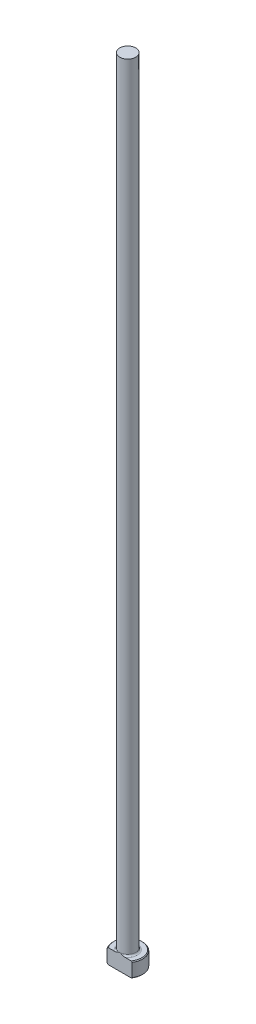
ISO-10303-21;
HEADER;
FILE_DESCRIPTION(('STEP AP214'),'2;1');
FILE_NAME('part.step','',(''),(''),'','','');
FILE_SCHEMA(('AUTOMOTIVE_DESIGN { 1 0 10303 214 1 1 1 1 }'));
ENDSEC;
DATA;
#1=APPLICATION_CONTEXT('core data for automotive mechanical design processes');
#2=APPLICATION_PROTOCOL_DEFINITION('international standard','automotive_design',2000,#1);
#3=PRODUCT_CONTEXT('',#1,'mechanical');
#4=PRODUCT('Part','Part','',(#3));
#5=PRODUCT_RELATED_PRODUCT_CATEGORY('part','',(#4));
#6=PRODUCT_DEFINITION_FORMATION('','',#4);
#7=PRODUCT_DEFINITION_CONTEXT('part definition',#1,'design');
#8=PRODUCT_DEFINITION('design','',#6,#7);
#9=PRODUCT_DEFINITION_SHAPE('','',#8);
#10=(LENGTH_UNIT() NAMED_UNIT(*) SI_UNIT(.MILLI.,.METRE.));
#11=(NAMED_UNIT(*) PLANE_ANGLE_UNIT() SI_UNIT($,.RADIAN.));
#12=(NAMED_UNIT(*) SI_UNIT($,.STERADIAN.) SOLID_ANGLE_UNIT());
#13=UNCERTAINTY_MEASURE_WITH_UNIT(LENGTH_MEASURE(1.E-05),#10,'distance_accuracy_value','');
#14=(GEOMETRIC_REPRESENTATION_CONTEXT(3) GLOBAL_UNCERTAINTY_ASSIGNED_CONTEXT((#13)) GLOBAL_UNIT_ASSIGNED_CONTEXT((#10,
#11,#12)) REPRESENTATION_CONTEXT('',''));
#15=CARTESIAN_POINT('',(0.,0.,0.));
#16=DIRECTION('',(0.,0.,1.));
#17=DIRECTION('',(1.,0.,0.));
#18=AXIS2_PLACEMENT_3D('',#15,#16,#17);
#19=CARTESIAN_POINT('',(0.,0.,0.));
#20=DIRECTION('',(0.,-1.,0.));
#21=DIRECTION('',(0.,0.,-1.));
#22=AXIS2_PLACEMENT_3D('',#19,#20,#21);
#23=PLANE('',#22);
#24=CARTESIAN_POINT('',(0.,0.,0.));
#25=DIRECTION('',(0.,-1.,0.));
#26=DIRECTION('',(0.,0.,-1.));
#27=AXIS2_PLACEMENT_3D('',#24,#25,#26);
#28=CIRCLE('',#27,4.5085);
#29=CARTESIAN_POINT('',(-3.69775913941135,0.,2.57936999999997));
#30=VERTEX_POINT('',#29);
#31=CARTESIAN_POINT('',(3.69775913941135,0.,2.57936999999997));
#32=VERTEX_POINT('',#31);
#33=EDGE_CURVE('E98',#30,#32,#28,.T.);
#34=ORIENTED_EDGE('',*,*,#33,.T.);
#35=DIRECTION('',(-1.,0.,0.));
#36=VECTOR('',#35,1.);
#37=CARTESIAN_POINT('',(-4.0035305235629,0.,2.57936999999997));
#38=LINE('',#37,#36);
#39=EDGE_CURVE('E83',#32,#30,#38,.T.);
#40=ORIENTED_EDGE('',*,*,#39,.T.);
#41=EDGE_LOOP('',(#34,#40));
#42=FACE_BOUND('',#41,.T.);
#43=ADVANCED_FACE('F32',(#42),#23,.T.);
#44=CARTESIAN_POINT('',(0.,259.958771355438,0.));
#45=DIRECTION('',(0.,1.,0.));
#46=DIRECTION('',(0.,0.,1.));
#47=AXIS2_PLACEMENT_3D('',#44,#45,#46);
#48=CYLINDRICAL_SURFACE('',#47,4.76249999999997);
#49=CARTESIAN_POINT('',(0.,4.49580000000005,0.));
#50=DIRECTION('',(0.,1.,0.));
#51=DIRECTION('',(0.,0.,1.));
#52=AXIS2_PLACEMENT_3D('',#49,#50,#51);
#53=CIRCLE('',#52,4.76249999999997);
#54=CARTESIAN_POINT('',(-4.0035305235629,4.49580000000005,2.57936999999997));
#55=VERTEX_POINT('',#54);
#56=CARTESIAN_POINT('',(4.0035305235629,4.49580000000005,2.57936999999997));
#57=VERTEX_POINT('',#56);
#58=EDGE_CURVE('E104',#55,#57,#53,.F.);
#59=ORIENTED_EDGE('',*,*,#58,.T.);
#60=DIRECTION('',(0.,-1.,0.));
#61=VECTOR('',#60,1.);
#62=CARTESIAN_POINT('',(4.0035305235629,254.,2.57936999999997));
#63=LINE('',#62,#61);
#64=CARTESIAN_POINT('',(4.0035305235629,0.254000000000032,2.57936999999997));
#65=VERTEX_POINT('',#64);
#66=EDGE_CURVE('E183',#57,#65,#63,.T.);
#67=ORIENTED_EDGE('',*,*,#66,.T.);
#68=CARTESIAN_POINT('',(0.,0.254000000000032,0.));
#69=DIRECTION('',(0.,-1.,0.));
#70=DIRECTION('',(0.,0.,-1.));
#71=AXIS2_PLACEMENT_3D('',#68,#69,#70);
#72=CIRCLE('',#71,4.76249999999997);
#73=CARTESIAN_POINT('',(-4.0035305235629,0.254000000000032,2.57936999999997));
#74=VERTEX_POINT('',#73);
#75=EDGE_CURVE('E100',#65,#74,#72,.F.);
#76=ORIENTED_EDGE('',*,*,#75,.T.);
#77=DIRECTION('',(0.,-1.,0.));
#78=VECTOR('',#77,1.);
#79=CARTESIAN_POINT('',(-4.0035305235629,254.,2.57936999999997));
#80=LINE('',#79,#78);
#81=EDGE_CURVE('E93',#55,#74,#80,.T.);
#82=ORIENTED_EDGE('',*,*,#81,.F.);
#83=EDGE_LOOP('',(#59,#67,#76,#82));
#84=FACE_BOUND('',#83,.T.);
#85=ADVANCED_FACE('F158',(#84),#48,.T.);
#86=CARTESIAN_POINT('',(-4.76249999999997,4.7498,0.));
#87=DIRECTION('',(0.,1.,0.));
#88=DIRECTION('',(0.,0.,1.));
#89=AXIS2_PLACEMENT_3D('',#86,#87,#88);
#90=PLANE('',#89);
#91=CARTESIAN_POINT('',(0.,4.7498,0.));
#92=DIRECTION('',(0.,1.,0.));
#93=DIRECTION('',(0.,0.,1.));
#94=AXIS2_PLACEMENT_3D('',#91,#92,#93);
#95=CIRCLE('',#94,4.50850000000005);
#96=CARTESIAN_POINT('',(3.69775913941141,4.7498,2.57936999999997));
#97=VERTEX_POINT('',#96);
#98=CARTESIAN_POINT('',(-3.69775913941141,4.7498,2.57936999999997));
#99=VERTEX_POINT('',#98);
#100=EDGE_CURVE('E178',#97,#99,#95,.T.);
#101=ORIENTED_EDGE('',*,*,#100,.T.);
#102=DIRECTION('',(1.,0.,0.));
#103=VECTOR('',#102,1.);
#104=CARTESIAN_POINT('',(-4.76249999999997,4.7498,2.57936999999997));
#105=LINE('',#104,#103);
#106=CARTESIAN_POINT('',(-1.69667437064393,4.74979999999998,2.57936999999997));
#107=VERTEX_POINT('',#106);
#108=EDGE_CURVE('E57',#99,#107,#105,.T.);
#109=ORIENTED_EDGE('',*,*,#108,.T.);
#110=CARTESIAN_POINT('',(0.,4.7498,0.));
#111=DIRECTION('',(0.,1.,0.));
#112=DIRECTION('',(0.,0.,1.));
#113=AXIS2_PLACEMENT_3D('',#110,#111,#112);
#114=CIRCLE('',#113,3.08736999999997);
#115=CARTESIAN_POINT('',(1.69667437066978,4.74979999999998,2.57936999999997));
#116=VERTEX_POINT('',#115);
#117=EDGE_CURVE('E107',#107,#116,#114,.F.);
#118=ORIENTED_EDGE('',*,*,#117,.T.);
#119=EDGE_CURVE('E136',#116,#97,#105,.T.);
#120=ORIENTED_EDGE('',*,*,#119,.T.);
#121=EDGE_LOOP('',(#101,#109,#118,#120));
#122=FACE_BOUND('',#121,.T.);
#123=ADVANCED_FACE('F147',(#122),#90,.T.);
#124=CARTESIAN_POINT('',(0.,4.74980000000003,0.));
#125=DIRECTION('',(0.,-1.,0.));
#126=DIRECTION('',(0.,0.,-1.));
#127=AXIS2_PLACEMENT_3D('',#124,#125,#126);
#128=CONICAL_SURFACE('',#127,4.50850000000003,0.78539816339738);
#129=ORIENTED_EDGE('',*,*,#58,.F.);
#130=CARTESIAN_POINT('',(-8.81038376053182,0.0781032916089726,2.57936999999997));
#131=CARTESIAN_POINT('',(-8.63817215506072,0.243370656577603,2.57936999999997));
#132=CARTESIAN_POINT('',(-8.46577580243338,0.408446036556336,2.57936999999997));
#133=CARTESIAN_POINT('',(-8.12052663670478,0.738121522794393,2.57936999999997));
#134=CARTESIAN_POINT('',(-7.94767381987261,0.90272162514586,2.57936999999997));
#135=CARTESIAN_POINT('',(-7.60137761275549,1.23139996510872,2.57936999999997));
#136=CARTESIAN_POINT('',(-7.42793406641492,1.39547803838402,2.57936999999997));
#137=CARTESIAN_POINT('',(-7.08039096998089,1.72293720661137,2.57936999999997));
#138=CARTESIAN_POINT('',(-6.90629142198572,1.88631830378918,2.57936999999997));
#139=CARTESIAN_POINT('',(-6.55996911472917,2.20971408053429,2.57936999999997));
#140=CARTESIAN_POINT('',(-6.38775863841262,2.36974190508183,2.57936999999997));
#141=CARTESIAN_POINT('',(-6.04236978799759,2.68874934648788,2.57936999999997));
#142=CARTESIAN_POINT('',(-5.86919141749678,2.8477289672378,2.57936999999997));
#143=CARTESIAN_POINT('',(-5.52163609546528,3.16432986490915,2.57936999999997));
#144=CARTESIAN_POINT('',(-5.34725929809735,3.32195131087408,2.57936999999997));
#145=CARTESIAN_POINT('',(-4.99694410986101,3.63544705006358,2.57936999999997));
#146=CARTESIAN_POINT('',(-4.82100574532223,3.79132137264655,2.57936999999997));
#147=CARTESIAN_POINT('',(-4.49753352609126,4.07410257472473,2.57936999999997));
#148=CARTESIAN_POINT('',(-4.35032232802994,4.20137795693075,2.57936999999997));
#149=CARTESIAN_POINT('',(-4.05409296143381,4.45384309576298,2.57936999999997));
#150=CARTESIAN_POINT('',(-3.90507461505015,4.579032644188,2.57936999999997));
#151=CARTESIAN_POINT('',(-3.60326498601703,4.82780550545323,2.57936999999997));
#152=CARTESIAN_POINT('',(-3.4504511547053,4.95136158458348,2.57936999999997));
#153=CARTESIAN_POINT('',(-3.14173703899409,5.19448315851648,2.57936999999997));
#154=CARTESIAN_POINT('',(-2.98583759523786,5.31404971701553,2.57936999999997));
#155=CARTESIAN_POINT('',(-2.66761175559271,5.54917953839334,2.57936999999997));
#156=CARTESIAN_POINT('',(-2.50522602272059,5.66466361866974,2.57936999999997));
#157=CARTESIAN_POINT('',(-2.25707238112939,5.83137640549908,2.57936999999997));
#158=CARTESIAN_POINT('',(-2.17352383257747,5.88590247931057,2.57936999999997));
#159=CARTESIAN_POINT('',(-2.00468213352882,5.99217332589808,2.57936999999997));
#160=CARTESIAN_POINT('',(-1.9193891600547,6.04391837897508,2.57936999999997));
#161=CARTESIAN_POINT('',(-1.747727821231,6.14335743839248,2.57936999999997));
#162=CARTESIAN_POINT('',(-1.66138240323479,6.19109052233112,2.57936999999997));
#163=CARTESIAN_POINT('',(-1.48644296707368,6.28221543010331,2.57936999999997));
#164=CARTESIAN_POINT('',(-1.39784850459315,6.32560638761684,2.57936999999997));
#165=CARTESIAN_POINT('',(-1.12872329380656,6.44731582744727,2.57936999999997));
#166=CARTESIAN_POINT('',(-0.944205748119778,6.5175637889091,2.57936999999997));
#167=CARTESIAN_POINT('',(-0.668471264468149,6.59500577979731,2.57936999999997));
#168=CARTESIAN_POINT('',(-0.58102669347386,6.61572186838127,2.57936999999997));
#169=CARTESIAN_POINT('',(-0.404544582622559,6.64883575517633,2.57936999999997));
#170=CARTESIAN_POINT('',(-0.315507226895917,6.66123450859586,2.57936999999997));
#171=CARTESIAN_POINT('',(-0.136997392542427,6.67681756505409,2.57936999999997));
#172=CARTESIAN_POINT('',(-0.0475283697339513,6.68004079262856,2.57936999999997));
#173=CARTESIAN_POINT('',(0.131260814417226,6.67713971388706,2.57936999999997));
#174=CARTESIAN_POINT('',(0.220580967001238,6.67101487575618,2.57936999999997));
#175=CARTESIAN_POINT('',(0.39751372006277,6.64994857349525,2.57936999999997));
#176=CARTESIAN_POINT('',(0.485133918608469,6.63506955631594,2.57936999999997));
#177=CARTESIAN_POINT('',(0.658668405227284,6.59750904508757,2.57936999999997));
#178=CARTESIAN_POINT('',(0.744582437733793,6.57482639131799,2.57936999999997));
#179=CARTESIAN_POINT('',(0.914923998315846,6.5226814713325,2.57936999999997));
#180=CARTESIAN_POINT('',(0.999337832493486,6.49317510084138,2.57936999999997));
#181=CARTESIAN_POINT('',(1.16599375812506,6.42867206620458,2.57936999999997));
#182=CARTESIAN_POINT('',(1.24823625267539,6.3936764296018,2.57936999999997));
#183=CARTESIAN_POINT('',(1.48320923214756,6.28604350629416,2.57936999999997));
#184=CARTESIAN_POINT('',(1.63331445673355,6.20769517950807,2.57936999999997));
#185=CARTESIAN_POINT('',(1.92762066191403,6.04050332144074,2.57936999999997));
#186=CARTESIAN_POINT('',(2.07181423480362,5.95164713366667,2.57936999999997));
#187=CARTESIAN_POINT('',(2.3560914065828,5.76650107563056,2.57936999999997));
#188=CARTESIAN_POINT('',(2.4961572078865,5.67018411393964,2.57936999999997));
#189=CARTESIAN_POINT('',(2.77263704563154,5.47262505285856,2.57936999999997));
#190=CARTESIAN_POINT('',(2.90905278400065,5.37138531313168,2.57936999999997));
#191=CARTESIAN_POINT('',(3.18076542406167,5.16408172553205,2.57936999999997));
#192=CARTESIAN_POINT('',(3.31602902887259,5.05797444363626,2.57936999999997));
#193=CARTESIAN_POINT('',(3.58438893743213,4.84303698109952,2.57936999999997));
#194=CARTESIAN_POINT('',(3.71748502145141,4.73420652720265,2.57936999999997));
#195=CARTESIAN_POINT('',(3.9816559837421,4.51474163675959,2.57936999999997));
#196=CARTESIAN_POINT('',(4.1127348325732,4.40411196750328,2.57936999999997));
#197=CARTESIAN_POINT('',(4.37353162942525,4.18125865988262,2.57936999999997));
#198=CARTESIAN_POINT('',(4.5032495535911,4.06903499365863,2.57936999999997));
#199=CARTESIAN_POINT('',(4.81441004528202,3.79717971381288,2.57936999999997));
#200=CARTESIAN_POINT('',(4.99531124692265,3.63692901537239,2.57936999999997));
#201=CARTESIAN_POINT('',(5.35546680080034,3.31458539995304,2.57936999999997));
#202=CARTESIAN_POINT('',(5.53472112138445,3.15249244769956,2.57936999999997));
#203=CARTESIAN_POINT('',(5.89210090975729,2.82676891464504,2.57936999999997));
#204=CARTESIAN_POINT('',(6.07022530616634,2.66313715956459,2.57936999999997));
#205=CARTESIAN_POINT('',(6.42546247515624,2.3347790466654,2.57936999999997));
#206=CARTESIAN_POINT('',(6.60257524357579,2.17005268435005,2.57936999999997));
#207=CARTESIAN_POINT('',(7.12035172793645,1.68613081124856,2.57936999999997));
#208=CARTESIAN_POINT('',(7.45991968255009,1.36576301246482,2.57936999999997));
#209=CARTESIAN_POINT('',(7.96758192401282,0.88377022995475,2.57936999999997));
#210=CARTESIAN_POINT('',(8.13643837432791,0.722945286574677,2.57936999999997));
#211=CARTESIAN_POINT('',(8.47371750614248,0.400843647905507,2.57936999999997));
#212=CARTESIAN_POINT('',(8.64214019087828,0.239566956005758,2.57936999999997));
#213=CARTESIAN_POINT('',(8.81038376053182,0.0781032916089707,2.57936999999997));
#214=B_SPLINE_CURVE_WITH_KNOTS('',3,(#130,#131,#132,#133,#134,#135,#136,#137,#138,#139,#140,
#141,#142,#143,#144,#145,#146,#147,#148,#149,#150,#151,#152,#153,#154,#155,#156,#157,#158,#159,
#160,#161,#162,#163,#164,#165,#166,#167,#168,#169,#170,#171,#172,#173,#174,#175,#176,#177,#178,
#179,#180,#181,#182,#183,#184,#185,#186,#187,#188,#189,#190,#191,#192,#193,#194,#195,#196,#197,
#198,#199,#200,#201,#202,#203,#204,#205,#206,#207,#208,#209,#210,#211,#212,#213),.UNSPECIFIED.,
.F.,.F.,(4,2,2,2,2,2,2,2,2,2,2,2,2,2,2,2,2,2,2,2,2,2,2,2,2,2,2,2,2,2,2,2,2,2,2,2,2,2,2,2,2,4),
(0.,0.716052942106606,1.432111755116,2.1483772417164,2.86464043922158,3.56989457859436,
4.27514609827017,4.98030853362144,5.68545910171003,6.26925198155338,6.85310278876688,
7.44259871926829,8.0319362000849,8.62950045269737,8.9287581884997,9.22798570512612,
9.52384148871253,9.81975618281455,10.409328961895,10.6785998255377,10.9478397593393,
11.2159358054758,11.4840471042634,11.7502686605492,12.0165297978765,12.2845625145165,
12.5525451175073,13.0597900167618,13.567652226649,14.077453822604,14.5870134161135,
15.1027140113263,15.6184665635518,16.1330234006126,16.6475892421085,17.372587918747,
18.097600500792,18.8232204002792,19.5488432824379,20.9493536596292,21.6489206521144,
22.3484824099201),.UNSPECIFIED.);
#215=EDGE_CURVE('E135',#55,#99,#214,.T.);
#216=ORIENTED_EDGE('',*,*,#215,.T.);
#217=ORIENTED_EDGE('',*,*,#100,.F.);
#218=EDGE_CURVE('E127',#97,#57,#214,.T.);
#219=ORIENTED_EDGE('',*,*,#218,.T.);
#220=EDGE_LOOP('',(#129,#216,#217,#219));
#221=FACE_BOUND('',#220,.T.);
#222=ADVANCED_FACE('F143',(#221),#128,.T.);
#223=CARTESIAN_POINT('',(0.,0.254000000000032,0.));
#224=DIRECTION('',(0.,1.,0.));
#225=DIRECTION('',(0.,0.,1.));
#226=AXIS2_PLACEMENT_3D('',#223,#224,#225);
#227=CONICAL_SURFACE('',#226,4.76249999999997,0.785398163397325);
#228=ORIENTED_EDGE('',*,*,#75,.F.);
#229=CARTESIAN_POINT('',(8.81038376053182,4.67169670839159,2.57936999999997));
#230=CARTESIAN_POINT('',(8.63817215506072,4.50642934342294,2.57936999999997));
#231=CARTESIAN_POINT('',(8.46577580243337,4.34135396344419,2.57936999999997));
#232=CARTESIAN_POINT('',(8.12052663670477,4.01167847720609,2.57936999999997));
#233=CARTESIAN_POINT('',(7.9476738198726,3.8470783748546,2.57936999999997));
#234=CARTESIAN_POINT('',(7.60137761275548,3.51840003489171,2.57936999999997));
#235=CARTESIAN_POINT('',(7.4279340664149,3.35432196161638,2.57936999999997));
#236=CARTESIAN_POINT('',(7.08039096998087,3.02686279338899,2.57936999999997));
#237=CARTESIAN_POINT('',(6.90629142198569,2.86348169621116,2.57936999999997));
#238=CARTESIAN_POINT('',(6.55996911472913,2.540085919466,2.57936999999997));
#239=CARTESIAN_POINT('',(6.38775863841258,2.38005809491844,2.57936999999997));
#240=CARTESIAN_POINT('',(6.04236978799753,2.06105065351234,2.57936999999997));
#241=CARTESIAN_POINT('',(5.86919141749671,1.9020710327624,2.57936999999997));
#242=CARTESIAN_POINT('',(5.5216360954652,1.585470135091,2.57936999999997));
#243=CARTESIAN_POINT('',(5.34725929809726,1.42784868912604,2.57936999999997));
#244=CARTESIAN_POINT('',(4.9969441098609,1.11435294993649,2.57936999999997));
#245=CARTESIAN_POINT('',(4.82100574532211,0.958478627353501,2.57936999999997));
#246=CARTESIAN_POINT('',(4.49753352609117,0.67569742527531,2.57936999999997));
#247=CARTESIAN_POINT('',(4.35032232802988,0.548422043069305,2.57936999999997));
#248=CARTESIAN_POINT('',(4.05409296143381,0.295956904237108,2.57936999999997));
#249=CARTESIAN_POINT('',(3.90507461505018,0.170767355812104,2.57936999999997));
#250=CARTESIAN_POINT('',(3.60326498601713,-0.0780055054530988,2.57936999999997));
#251=CARTESIAN_POINT('',(3.45045115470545,-0.201561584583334,2.57936999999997));
#252=CARTESIAN_POINT('',(3.14173703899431,-0.444683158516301,2.57936999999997));
#253=CARTESIAN_POINT('',(2.98583759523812,-0.564249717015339,2.57936999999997));
#254=CARTESIAN_POINT('',(2.66761175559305,-0.799379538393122,2.57936999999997));
#255=CARTESIAN_POINT('',(2.50522602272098,-0.91486361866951,2.57936999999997));
#256=CARTESIAN_POINT('',(2.25707238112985,-1.08157640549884,2.57936999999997));
#257=CARTESIAN_POINT('',(2.17352383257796,-1.13610247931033,2.57936999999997));
#258=CARTESIAN_POINT('',(2.00468213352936,-1.24237332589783,2.57936999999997));
#259=CARTESIAN_POINT('',(1.91938916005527,-1.29411837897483,2.57936999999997));
#260=CARTESIAN_POINT('',(1.74772782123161,-1.39355743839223,2.57936999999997));
#261=CARTESIAN_POINT('',(1.66138240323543,-1.44129052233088,2.57936999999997));
#262=CARTESIAN_POINT('',(1.48644296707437,-1.53241543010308,2.57936999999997));
#263=CARTESIAN_POINT('',(1.39784850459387,-1.57580638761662,2.57936999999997));
#264=CARTESIAN_POINT('',(1.12872329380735,-1.69751582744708,2.57936999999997));
#265=CARTESIAN_POINT('',(0.944205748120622,-1.76776378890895,2.57936999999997));
#266=CARTESIAN_POINT('',(0.668471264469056,-1.84520577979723,2.57936999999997));
#267=CARTESIAN_POINT('',(0.581026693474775,-1.86592186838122,2.57936999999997));
#268=CARTESIAN_POINT('',(0.40454458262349,-1.89903575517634,2.57936999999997));
#269=CARTESIAN_POINT('',(0.315507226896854,-1.9114345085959,2.57936999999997));
#270=CARTESIAN_POINT('',(0.136997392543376,-1.92701756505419,2.57936999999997));
#271=CARTESIAN_POINT('',(0.0475283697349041,-1.9302407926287,2.57936999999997));
#272=CARTESIAN_POINT('',(-0.131260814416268,-1.92733971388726,2.57936999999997));
#273=CARTESIAN_POINT('',(-0.220580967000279,-1.92121487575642,2.57936999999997));
#274=CARTESIAN_POINT('',(-0.397513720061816,-1.90014857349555,2.57936999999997));
#275=CARTESIAN_POINT('',(-0.485133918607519,-1.88526955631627,2.57936999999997));
#276=CARTESIAN_POINT('',(-0.658668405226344,-1.84770904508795,2.57936999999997));
#277=CARTESIAN_POINT('',(-0.744582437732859,-1.8250263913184,2.57936999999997));
#278=CARTESIAN_POINT('',(-0.914923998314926,-1.77288147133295,2.57936999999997));
#279=CARTESIAN_POINT('',(-0.999337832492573,-1.74337510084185,2.57936999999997));
#280=CARTESIAN_POINT('',(-1.16599375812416,-1.67887206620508,2.57936999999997));
#281=CARTESIAN_POINT('',(-1.2482362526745,-1.64387642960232,2.57936999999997));
#282=CARTESIAN_POINT('',(-1.48320923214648,-1.5362435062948,2.57936999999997));
#283=CARTESIAN_POINT('',(-1.63331445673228,-1.45789517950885,2.57936999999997));
#284=CARTESIAN_POINT('',(-1.92762066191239,-1.2907033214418,2.57936999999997));
#285=CARTESIAN_POINT('',(-2.07181423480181,-1.20184713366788,2.57936999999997));
#286=CARTESIAN_POINT('',(-2.35609140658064,-1.01670107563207,2.57936999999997));
#287=CARTESIAN_POINT('',(-2.49615720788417,-0.920384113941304,2.57936999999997));
#288=CARTESIAN_POINT('',(-2.77263704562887,-0.722825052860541,2.57936999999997));
#289=CARTESIAN_POINT('',(-2.90905278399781,-0.621585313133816,2.57936999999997));
#290=CARTESIAN_POINT('',(-3.1807654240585,-0.414281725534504,2.57936999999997));
#291=CARTESIAN_POINT('',(-3.31602902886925,-0.308174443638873,2.57936999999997));
#292=CARTESIAN_POINT('',(-3.58438893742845,-0.0932369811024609,2.57936999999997));
#293=CARTESIAN_POINT('',(-3.71748502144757,0.015593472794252,2.57936999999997));
#294=CARTESIAN_POINT('',(-3.98165598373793,0.235058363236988,2.57936999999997));
#295=CARTESIAN_POINT('',(-4.11273483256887,0.345688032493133,2.57936999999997));
#296=CARTESIAN_POINT('',(-4.37353162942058,0.568541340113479,2.57936999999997));
#297=CARTESIAN_POINT('',(-4.50324955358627,0.680765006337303,2.57936999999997));
#298=CARTESIAN_POINT('',(-4.81441004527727,0.95262028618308,2.57936999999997));
#299=CARTESIAN_POINT('',(-4.99531124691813,1.11287098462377,2.57936999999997));
#300=CARTESIAN_POINT('',(-5.35546680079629,1.43521460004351,2.57936999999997));
#301=CARTESIAN_POINT('',(-5.53472112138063,1.5973075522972,2.57936999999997));
#302=CARTESIAN_POINT('',(-5.89210090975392,1.92303108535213,2.57936999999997));
#303=CARTESIAN_POINT('',(-6.07022530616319,2.08666284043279,2.57936999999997));
#304=CARTESIAN_POINT('',(-6.42546247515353,2.41502095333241,2.57936999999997));
#305=CARTESIAN_POINT('',(-6.60257524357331,2.57974731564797,2.57936999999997));
#306=CARTESIAN_POINT('',(-7.12035172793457,3.06366918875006,2.57936999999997));
#307=CARTESIAN_POINT('',(-7.45991968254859,3.38403698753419,2.57936999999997));
#308=CARTESIAN_POINT('',(-7.96758192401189,3.86602977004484,2.57936999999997));
#309=CARTESIAN_POINT('',(-8.13643837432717,4.02685471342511,2.57936999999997));
#310=CARTESIAN_POINT('',(-8.47371750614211,4.34895635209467,2.57936999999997));
#311=CARTESIAN_POINT('',(-8.64214019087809,4.51023304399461,2.57936999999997));
#312=CARTESIAN_POINT('',(-8.81038376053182,4.67169670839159,2.57936999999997));
#313=B_SPLINE_CURVE_WITH_KNOTS('',3,(#229,#230,#231,#232,#233,#234,#235,#236,#237,#238,#239,
#240,#241,#242,#243,#244,#245,#246,#247,#248,#249,#250,#251,#252,#253,#254,#255,#256,#257,#258,
#259,#260,#261,#262,#263,#264,#265,#266,#267,#268,#269,#270,#271,#272,#273,#274,#275,#276,#277,
#278,#279,#280,#281,#282,#283,#284,#285,#286,#287,#288,#289,#290,#291,#292,#293,#294,#295,#296,
#297,#298,#299,#300,#301,#302,#303,#304,#305,#306,#307,#308,#309,#310,#311,#312),.UNSPECIFIED.,
.F.,.F.,(4,2,2,2,2,2,2,2,2,2,2,2,2,2,2,2,2,2,2,2,2,2,2,2,2,2,2,2,2,2,2,2,2,2,2,2,2,2,2,2,2,4),
(0.,0.716052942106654,1.4321117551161,2.14837724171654,2.86464043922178,3.56989457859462,
4.2751460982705,4.98030853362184,5.6854591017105,6.26925198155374,6.85310278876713,
7.44259871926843,8.03193620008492,8.62950045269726,8.92875818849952,9.22798570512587,
9.52384148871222,9.81975618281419,10.4093289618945,10.6785998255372,10.9478397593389,
11.2159358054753,11.4840471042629,11.7502686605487,12.016529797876,12.284562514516,
12.5525451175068,13.0597900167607,13.5676522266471,14.0774538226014,14.5870134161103,
15.1027140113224,15.6184665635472,16.1330234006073,16.6475892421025,17.3725879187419,
18.0976005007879,18.8232204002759,19.5488432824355,20.9493536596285,21.6489206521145,
22.348482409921),.UNSPECIFIED.);
#314=EDGE_CURVE('E86',#65,#32,#313,.T.);
#315=ORIENTED_EDGE('',*,*,#314,.T.);
#316=ORIENTED_EDGE('',*,*,#33,.F.);
#317=EDGE_CURVE('E89',#30,#74,#313,.T.);
#318=ORIENTED_EDGE('',*,*,#317,.T.);
#319=EDGE_LOOP('',(#228,#315,#316,#318));
#320=FACE_BOUND('',#319,.T.);
#321=ADVANCED_FACE('F97',(#320),#227,.T.);
#322=CARTESIAN_POINT('',(0.,5.25779999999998,0.));
#323=DIRECTION('',(0.,1.,0.));
#324=DIRECTION('',(0.,0.,1.));
#325=AXIS2_PLACEMENT_3D('',#322,#323,#324);
#326=TOROIDAL_SURFACE('',#325,3.08736999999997,0.508);
#327=CARTESIAN_POINT('',(0.,5.25779999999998,2.57936999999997));
#328=CARTESIAN_POINT('',(-5.16518117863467E-12,5.25780081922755,2.57936999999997));
#329=CARTESIAN_POINT('',(1.51484420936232E-07,5.25780163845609,2.57936999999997));
#330=CARTESIAN_POINT('',(6.43299144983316E-07,5.25780322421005,2.57936999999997));
#331=CARTESIAN_POINT('',(9.8735122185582E-07,5.25780398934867,2.57936999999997));
#332=CARTESIAN_POINT('',(1.817825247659E-06,5.2578055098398,2.57936999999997));
#333=CARTESIAN_POINT('',(2.31279301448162E-06,5.25780626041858,2.57936999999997));
#334=CARTESIAN_POINT('',(3.38841148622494E-06,5.25780768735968,2.57936999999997));
#335=CARTESIAN_POINT('',(3.96852619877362E-06,5.25780836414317,2.57936999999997));
#336=CARTESIAN_POINT('',(6.02232517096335E-06,5.2578105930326,2.57936999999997));
#337=CARTESIAN_POINT('',(7.60876090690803E-06,5.25781204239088,2.57936999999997));
#338=CARTESIAN_POINT('',(1.09144316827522E-05,5.2578146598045,2.57936999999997));
#339=CARTESIAN_POINT('',(1.26285070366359E-05,5.25781583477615,2.57936999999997));
#340=CARTESIAN_POINT('',(1.92076768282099E-05,5.25782015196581,2.57936999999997));
#341=CARTESIAN_POINT('',(2.42326163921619E-05,5.25782305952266,2.57936999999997));
#342=CARTESIAN_POINT('',(3.42287632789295E-05,5.25782790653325,2.57936999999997));
#343=CARTESIAN_POINT('',(3.91726975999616E-05,5.25782990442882,2.57936999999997));
#344=CARTESIAN_POINT('',(5.99187372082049E-05,5.25783822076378,2.57936999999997));
#345=CARTESIAN_POINT('',(7.57635082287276E-05,5.25784440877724,2.57936999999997));
#346=CARTESIAN_POINT('',(0.000105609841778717,5.25785451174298,2.57936999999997));
#347=CARTESIAN_POINT('',(0.000119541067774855,5.25785862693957,2.57936999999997));
#348=CARTESIAN_POINT('',(0.000219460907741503,5.25789075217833,2.57936999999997));
#349=CARTESIAN_POINT('',(0.000300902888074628,5.25793107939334,2.57936999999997));
#350=CARTESIAN_POINT('',(0.000615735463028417,5.25808116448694,2.57936999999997));
#351=CARTESIAN_POINT('',(0.000852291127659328,5.25818177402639,2.57936999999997));
#352=CARTESIAN_POINT('',(0.00176415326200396,5.25857549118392,2.57936999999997));
#353=CARTESIAN_POINT('',(0.00243620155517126,5.2588781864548,2.57936999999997));
#354=CARTESIAN_POINT('',(0.00516457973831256,5.26010105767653,2.57936999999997));
#355=CARTESIAN_POINT('',(0.0072244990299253,5.26101048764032,2.57936999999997));
#356=CARTESIAN_POINT('',(0.0516109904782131,5.28061414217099,2.57936999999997));
#357=CARTESIAN_POINT('',(0.0938952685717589,5.29943717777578,2.57936999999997));
#358=CARTESIAN_POINT('',(0.177053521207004,5.33615376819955,2.57936999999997));
#359=CARTESIAN_POINT('',(0.217923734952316,5.35405645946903,2.57936999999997));
#360=CARTESIAN_POINT('',(0.304435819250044,5.39155640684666,2.57936999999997));
#361=CARTESIAN_POINT('',(0.350094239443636,5.41111614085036,2.57936999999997));
#362=CARTESIAN_POINT('',(0.442134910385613,5.44978327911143,2.57936999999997));
#363=CARTESIAN_POINT('',(0.488519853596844,5.46888429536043,2.57936999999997));
#364=CARTESIAN_POINT('',(0.56995305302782,5.50150526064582,2.57936999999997));
#365=CARTESIAN_POINT('',(0.604922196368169,5.51522189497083,2.57936999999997));
#366=CARTESIAN_POINT('',(0.675011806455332,5.54200771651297,2.57936999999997));
#367=CARTESIAN_POINT('',(0.710131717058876,5.5550783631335,2.57936999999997));
#368=CARTESIAN_POINT('',(0.814404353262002,5.59266342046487,2.57936999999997));
#369=CARTESIAN_POINT('',(0.883936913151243,5.61614853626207,2.57936999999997));
#370=CARTESIAN_POINT('',(1.00782425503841,5.65429216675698,2.57936999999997));
#371=CARTESIAN_POINT('',(1.06193718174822,5.66973187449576,2.57936999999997));
#372=CARTESIAN_POINT('',(1.17120391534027,5.69793020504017,2.57936999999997));
#373=CARTESIAN_POINT('',(1.22636195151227,5.7106726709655,2.57936999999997));
#374=CARTESIAN_POINT('',(1.34027186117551,5.733297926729,2.57936999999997));
#375=CARTESIAN_POINT('',(1.39906110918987,5.74299686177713,2.57936999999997));
#376=CARTESIAN_POINT('',(1.51721875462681,5.75768002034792,2.57936999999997));
#377=CARTESIAN_POINT('',(1.57658680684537,5.76266689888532,2.57936999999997));
#378=CARTESIAN_POINT('',(1.69511346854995,5.76678671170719,2.57936999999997));
#379=CARTESIAN_POINT('',(1.75427029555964,5.76596338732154,2.57936999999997));
#380=CARTESIAN_POINT('',(1.87149560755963,5.75719278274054,2.57936999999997));
#381=CARTESIAN_POINT('',(1.92956894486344,5.74932260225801,2.57936999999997));
#382=CARTESIAN_POINT('',(2.0327750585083,5.72719067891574,2.57936999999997));
#383=CARTESIAN_POINT('',(2.07823018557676,5.71446753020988,2.57936999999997));
#384=CARTESIAN_POINT('',(2.16677670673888,5.68214897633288,2.57936999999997));
#385=CARTESIAN_POINT('',(2.20986769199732,5.66255238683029,2.57936999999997));
#386=CARTESIAN_POINT('',(2.27685325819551,5.62374143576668,2.57936999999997));
#387=CARTESIAN_POINT('',(2.30211074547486,5.60688619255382,2.57936999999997));
#388=CARTESIAN_POINT('',(2.3498129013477,5.56957626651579,2.57936999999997));
#389=CARTESIAN_POINT('',(2.37226240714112,5.54912792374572,2.57936999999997));
#390=CARTESIAN_POINT('',(2.40911621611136,5.50898487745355,2.57936999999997));
#391=CARTESIAN_POINT('',(2.42423272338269,5.48994804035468,2.57936999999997));
#392=CARTESIAN_POINT('',(2.45117344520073,5.4496467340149,2.57936999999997));
#393=CARTESIAN_POINT('',(2.46299882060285,5.42838305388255,2.57936999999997));
#394=CARTESIAN_POINT('',(2.48266593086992,5.38382179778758,2.57936999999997));
#395=CARTESIAN_POINT('',(2.49046972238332,5.36050719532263,2.57936999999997));
#396=CARTESIAN_POINT('',(2.50124559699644,5.3127873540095,2.57936999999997));
#397=CARTESIAN_POINT('',(2.50422280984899,5.28838330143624,2.57936999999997));
#398=CARTESIAN_POINT('',(2.50501174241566,5.24318646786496,2.57936999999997));
#399=CARTESIAN_POINT('',(2.50353379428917,5.22240326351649,2.57936999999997));
#400=CARTESIAN_POINT('',(2.49701302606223,5.18140922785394,2.57936999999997));
#401=CARTESIAN_POINT('',(2.49197045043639,5.16119835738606,2.57936999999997));
#402=CARTESIAN_POINT('',(2.47880825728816,5.12234647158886,2.57936999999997));
#403=CARTESIAN_POINT('',(2.47076323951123,5.10367981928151,2.57936999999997));
#404=CARTESIAN_POINT('',(2.45202195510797,5.06774073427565,2.57936999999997));
#405=CARTESIAN_POINT('',(2.44132479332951,5.05046877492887,2.57936999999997));
#406=CARTESIAN_POINT('',(2.41264913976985,5.01040991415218,2.57936999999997));
#407=CARTESIAN_POINT('',(2.39351791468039,4.98844679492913,2.57936999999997));
#408=CARTESIAN_POINT('',(2.35195533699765,4.94788822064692,2.57936999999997));
#409=CARTESIAN_POINT('',(2.32951584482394,4.92930133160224,2.57936999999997));
#410=CARTESIAN_POINT('',(2.27212089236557,4.88805946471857,2.57936999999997));
#411=CARTESIAN_POINT('',(2.23594381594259,4.8671115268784,2.57936999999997));
#412=CARTESIAN_POINT('',(2.16088211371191,4.83115661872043,2.57936999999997));
#413=CARTESIAN_POINT('',(2.12199848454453,4.81614747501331,2.57936999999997));
#414=CARTESIAN_POINT('',(2.01952915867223,4.78387953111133,2.57936999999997));
#415=CARTESIAN_POINT('',(1.95476069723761,4.77041241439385,2.57936999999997));
#416=CARTESIAN_POINT('',(1.82325899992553,4.75317677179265,2.57936999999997));
#417=CARTESIAN_POINT('',(1.75651107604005,4.74954018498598,2.57936999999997));
#418=CARTESIAN_POINT('',(1.62765031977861,4.75006910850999,2.57936999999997));
#419=CARTESIAN_POINT('',(1.56553120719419,4.75372045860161,2.57936999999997));
#420=CARTESIAN_POINT('',(1.44173714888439,4.76645870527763,2.57936999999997));
#421=CARTESIAN_POINT('',(1.38006361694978,4.77555855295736,2.57936999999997));
#422=CARTESIAN_POINT('',(1.26072840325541,4.79752312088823,2.57936999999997));
#423=CARTESIAN_POINT('',(1.20302493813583,4.81016732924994,2.57936999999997));
#424=CARTESIAN_POINT('',(1.08875557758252,4.83852906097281,2.57936999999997));
#425=CARTESIAN_POINT('',(1.03218495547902,4.8542278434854,2.57936999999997));
#426=CARTESIAN_POINT('',(0.904206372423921,4.89282915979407,2.57936999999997));
#427=CARTESIAN_POINT('',(0.833038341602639,4.91652173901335,2.57936999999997));
#428=CARTESIAN_POINT('',(0.726339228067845,4.95457466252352,2.57936999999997));
#429=CARTESIAN_POINT('',(0.690404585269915,4.96783098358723,2.57936999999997));
#430=CARTESIAN_POINT('',(0.618698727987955,4.99503257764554,2.57936999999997));
#431=CARTESIAN_POINT('',(0.582928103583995,5.00897941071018,2.57936999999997));
#432=CARTESIAN_POINT('',(0.499599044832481,5.04219527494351,2.57936999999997));
#433=CARTESIAN_POINT('',(0.452125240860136,5.06167571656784,2.57936999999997));
#434=CARTESIAN_POINT('',(0.357936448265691,5.10114404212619,2.57936999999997));
#435=CARTESIAN_POINT('',(0.311218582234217,5.12112508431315,2.57936999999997));
#436=CARTESIAN_POINT('',(0.222709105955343,5.15945063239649,2.57936999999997));
#437=CARTESIAN_POINT('',(0.180899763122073,5.17775487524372,2.57936999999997));
#438=CARTESIAN_POINT('',(0.0958335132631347,5.21530359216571,2.57936999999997));
#439=CARTESIAN_POINT('',(0.0525805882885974,5.23455771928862,2.57936999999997));
#440=CARTESIAN_POINT('',(0.00722442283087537,5.25458954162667,2.57936999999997));
#441=CARTESIAN_POINT('',(0.00516442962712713,5.25549900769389,2.57936999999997));
#442=CARTESIAN_POINT('',(0.0024360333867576,5.25672188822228,2.57936999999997));
#443=CARTESIAN_POINT('',(0.00176404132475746,5.2570245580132,2.57936999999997));
#444=CARTESIAN_POINT('',(0.000852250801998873,5.25741824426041,2.57936999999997));
#445=CARTESIAN_POINT('',(0.000615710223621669,5.25751884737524,2.57936999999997));
#446=CARTESIAN_POINT('',(0.000300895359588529,5.25766892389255,2.57936999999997));
#447=CARTESIAN_POINT('',(0.000219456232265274,5.25770924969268,2.57936999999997));
#448=CARTESIAN_POINT('',(0.0001195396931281,5.25774137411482,2.57936999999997));
#449=CARTESIAN_POINT('',(0.000105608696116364,5.25774548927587,2.57936999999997));
#450=CARTESIAN_POINT('',(7.57628586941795E-05,5.25775559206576,2.57936999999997));
#451=CARTESIAN_POINT('',(5.99183486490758E-05,5.25776177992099,2.57936999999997));
#452=CARTESIAN_POINT('',(3.91726023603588E-05,5.2577700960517,2.57936999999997));
#453=CARTESIAN_POINT('',(3.4228705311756E-05,5.25777209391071,2.57936999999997));
#454=CARTESIAN_POINT('',(2.42326273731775E-05,5.25777694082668,2.57936999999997));
#455=CARTESIAN_POINT('',(1.92077182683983E-05,5.25777984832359,2.57936999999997));
#456=CARTESIAN_POINT('',(1.26285764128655E-05,5.25778416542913,2.57936999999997));
#457=CARTESIAN_POINT('',(1.09145040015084E-05,5.25778534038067,2.57936999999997));
#458=CARTESIAN_POINT('',(7.60883504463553E-06,5.257787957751,2.57936999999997));
#459=CARTESIAN_POINT('',(6.02239802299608E-06,5.25778940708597,2.57936999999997));
#460=CARTESIAN_POINT('',(3.96859240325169E-06,5.25779163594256,2.57936999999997));
#461=CARTESIAN_POINT('',(3.38847481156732E-06,5.25779231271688,2.57936999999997));
#462=CARTESIAN_POINT('',(2.31284894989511E-06,5.2577937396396,2.57936999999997));
#463=CARTESIAN_POINT('',(1.81787665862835E-06,5.25779449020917,2.57936999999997));
#464=CARTESIAN_POINT('',(9.87391666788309E-07,5.25779601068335,2.57936999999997));
#465=CARTESIAN_POINT('',(6.43333334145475E-07,5.25779677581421,2.57936999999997));
#466=CARTESIAN_POINT('',(1.51503512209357E-07,5.25779836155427,2.57936999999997));
#467=CARTESIAN_POINT('',(5.16515442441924E-12,5.25779918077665,2.57936999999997));
#468=CARTESIAN_POINT('',(0.,5.25779999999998,2.57936999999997));
#469=B_SPLINE_CURVE_WITH_KNOTS('',3,(#327,#328,#329,#330,#331,#332,#333,#334,#335,#336,#337,
#338,#339,#340,#341,#342,#343,#344,#345,#346,#347,#348,#349,#350,#351,#352,#353,#354,#355,#356,
#357,#358,#359,#360,#361,#362,#363,#364,#365,#366,#367,#368,#369,#370,#371,#372,#373,#374,#375,
#376,#377,#378,#379,#380,#381,#382,#383,#384,#385,#386,#387,#388,#389,#390,#391,#392,#393,#394,
#395,#396,#397,#398,#399,#400,#401,#402,#403,#404,#405,#406,#407,#408,#409,#410,#411,#412,#413,
#414,#415,#416,#417,#418,#419,#420,#421,#422,#423,#424,#425,#426,#427,#428,#429,#430,#431,#432,
#433,#434,#435,#436,#437,#438,#439,#440,#441,#442,#443,#444,#445,#446,#447,#448,#449,#450,#451,
#452,#453,#454,#455,#456,#457,#458,#459,#460,#461,#462,#463,#464,#465,#466,#467,#468),
.UNSPECIFIED.,.T.,.F.,(4,2,2,2,2,2,2,2,2,2,2,2,2,2,2,2,2,2,2,2,2,2,2,2,2,2,2,2,2,2,2,2,2,2,2,2,
2,2,2,2,2,2,2,2,2,2,2,2,2,2,2,2,2,2,2,2,2,2,2,2,2,2,2,2,2,2,2,2,2,2,4),(0.,2.45543130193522E-06,
4.96011664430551E-06,7.64727100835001E-06,1.03181829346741E-05,1.67328286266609E-05,
2.29621830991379E-05,4.03178443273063E-05,5.62987277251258E-05,0.000107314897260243,
0.000150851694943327,0.000422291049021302,0.00119444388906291,0.00340445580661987,
0.0101609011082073,0.148997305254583,0.282858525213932,0.431869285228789,0.582353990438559,
0.695037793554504,0.807454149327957,1.02753769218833,1.19629804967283,1.36604236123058,
1.54464159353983,1.72314013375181,1.90029631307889,2.07553759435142,2.2167370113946,
2.35796076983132,2.44878832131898,2.53945718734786,2.61210671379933,2.68473058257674,
2.7580276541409,2.83124677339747,2.89344023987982,2.95562944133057,3.01636649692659,
3.07712408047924,3.16401797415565,3.25112934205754,3.37584152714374,3.50050802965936,
3.69786973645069,3.89786745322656,4.0842534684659,4.27108429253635,4.44819465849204,
4.62425083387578,4.84917322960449,4.96407456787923,5.07924853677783,5.23318642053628,
5.38561607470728,5.52254130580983,5.66455801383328,5.67131470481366,5.67352453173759,
5.6742966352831,5.6745680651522,5.67461160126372,5.67466261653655,5.67467859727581,
5.6746959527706,5.6747021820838,5.67470859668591,5.67471126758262,5.67471395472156,
5.67471645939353,5.67471891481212),.UNSPECIFIED.);
#470=CARTESIAN_POINT('',(0.,5.25779999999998,2.57936999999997));
#471=VERTEX_POINT('',#470);
#472=EDGE_CURVE('E11',#116,#471,#469,.T.);
#473=ORIENTED_EDGE('',*,*,#472,.F.);
#474=ORIENTED_EDGE('',*,*,#117,.F.);
#475=CARTESIAN_POINT('',(0.,5.25779999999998,2.57936999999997));
#476=CARTESIAN_POINT('',(5.16517077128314E-12,5.2577991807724,2.57936999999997));
#477=CARTESIAN_POINT('',(-1.51484420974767E-07,5.25779836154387,2.57936999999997));
#478=CARTESIAN_POINT('',(-6.43299145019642E-07,5.25779677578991,2.57936999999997));
#479=CARTESIAN_POINT('',(-9.87351221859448E-07,5.25779601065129,2.57936999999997));
#480=CARTESIAN_POINT('',(-1.81782524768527E-06,5.25779449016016,2.57936999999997));
#481=CARTESIAN_POINT('',(-2.31279301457E-06,5.25779373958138,2.57936999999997));
#482=CARTESIAN_POINT('',(-3.38841148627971E-06,5.25779231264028,2.57936999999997));
#483=CARTESIAN_POINT('',(-3.96852619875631E-06,5.25779163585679,2.57936999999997));
#484=CARTESIAN_POINT('',(-6.02232517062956E-06,5.25778940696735,2.57936999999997));
#485=CARTESIAN_POINT('',(-7.60876090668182E-06,5.25778795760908,2.57936999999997));
#486=CARTESIAN_POINT('',(-1.09144316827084E-05,5.25778534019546,2.57936999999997));
#487=CARTESIAN_POINT('',(-1.26285070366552E-05,5.25778416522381,2.57936999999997));
#488=CARTESIAN_POINT('',(-1.92076768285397E-05,5.25777984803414,2.57936999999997));
#489=CARTESIAN_POINT('',(-2.42326163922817E-05,5.2577769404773,2.57936999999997));
#490=CARTESIAN_POINT('',(-3.42287632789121E-05,5.25777209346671,2.57936999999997));
#491=CARTESIAN_POINT('',(-3.91726975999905E-05,5.25777009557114,2.57936999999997));
#492=CARTESIAN_POINT('',(-5.99187372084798E-05,5.25776177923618,2.57936999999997));
#493=CARTESIAN_POINT('',(-7.57635082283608E-05,5.25775559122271,2.57936999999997));
#494=CARTESIAN_POINT('',(-0.000105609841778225,5.25774548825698,2.57936999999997));
#495=CARTESIAN_POINT('',(-0.000119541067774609,5.25774137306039,2.57936999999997));
#496=CARTESIAN_POINT('',(-0.000219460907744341,5.25770924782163,2.57936999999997));
#497=CARTESIAN_POINT('',(-0.000300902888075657,5.25766892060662,2.57936999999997));
#498=CARTESIAN_POINT('',(-0.000615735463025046,5.25751883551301,2.57936999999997));
#499=CARTESIAN_POINT('',(-0.000852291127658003,5.25741822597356,2.57936999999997));
#500=CARTESIAN_POINT('',(-0.00176415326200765,5.25702450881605,2.57936999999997));
#501=CARTESIAN_POINT('',(-0.00243620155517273,5.25672181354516,2.57936999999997));
#502=CARTESIAN_POINT('',(-0.00516457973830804,5.25549894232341,2.57936999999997));
#503=CARTESIAN_POINT('',(-0.00722449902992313,5.25458951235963,2.57936999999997));
#504=CARTESIAN_POINT('',(-0.0516109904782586,5.2349858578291,2.57936999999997));
#505=CARTESIAN_POINT('',(-0.0938952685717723,5.21616282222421,2.57936999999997));
#506=CARTESIAN_POINT('',(-0.177053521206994,5.17944623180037,2.57936999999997));
#507=CARTESIAN_POINT('',(-0.217923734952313,5.16154354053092,2.57936999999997));
#508=CARTESIAN_POINT('',(-0.304435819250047,5.12404359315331,2.57936999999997));
#509=CARTESIAN_POINT('',(-0.350094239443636,5.1044838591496,2.57936999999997));
#510=CARTESIAN_POINT('',(-0.442134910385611,5.06581672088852,2.57936999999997));
#511=CARTESIAN_POINT('',(-0.488519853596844,5.04671570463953,2.57936999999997));
#512=CARTESIAN_POINT('',(-0.56995305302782,5.01409473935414,2.57936999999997));
#513=CARTESIAN_POINT('',(-0.604922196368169,5.00037810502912,2.57936999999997));
#514=CARTESIAN_POINT('',(-0.675011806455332,4.97359228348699,2.57936999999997));
#515=CARTESIAN_POINT('',(-0.710131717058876,4.96052163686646,2.57936999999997));
#516=CARTESIAN_POINT('',(-0.814404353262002,4.92293657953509,2.57936999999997));
#517=CARTESIAN_POINT('',(-0.883936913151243,4.89945146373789,2.57936999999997));
#518=CARTESIAN_POINT('',(-1.00782425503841,4.86130783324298,2.57936999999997));
#519=CARTESIAN_POINT('',(-1.06193718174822,4.8458681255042,2.57936999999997));
#520=CARTESIAN_POINT('',(-1.17120391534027,4.81766979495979,2.57936999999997));
#521=CARTESIAN_POINT('',(-1.22636195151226,4.80492732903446,2.57936999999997));
#522=CARTESIAN_POINT('',(-1.34027186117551,4.78230207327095,2.57936999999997));
#523=CARTESIAN_POINT('',(-1.39906110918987,4.77260313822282,2.57936999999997));
#524=CARTESIAN_POINT('',(-1.51721875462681,4.75791997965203,2.57936999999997));
#525=CARTESIAN_POINT('',(-1.57658680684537,4.75293310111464,2.57936999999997));
#526=CARTESIAN_POINT('',(-1.69511346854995,4.74881328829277,2.57936999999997));
#527=CARTESIAN_POINT('',(-1.75427029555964,4.74963661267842,2.57936999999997));
#528=CARTESIAN_POINT('',(-1.87149560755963,4.75840721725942,2.57936999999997));
#529=CARTESIAN_POINT('',(-1.92956894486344,4.76627739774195,2.57936999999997));
#530=CARTESIAN_POINT('',(-2.0327750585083,4.78840932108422,2.57936999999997));
#531=CARTESIAN_POINT('',(-2.07823018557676,4.80113246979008,2.57936999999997));
#532=CARTESIAN_POINT('',(-2.16677670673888,4.83345102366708,2.57936999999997));
#533=CARTESIAN_POINT('',(-2.20986769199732,4.85304761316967,2.57936999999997));
#534=CARTESIAN_POINT('',(-2.27685325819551,4.89185856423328,2.57936999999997));
#535=CARTESIAN_POINT('',(-2.30211074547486,4.90871380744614,2.57936999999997));
#536=CARTESIAN_POINT('',(-2.3498129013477,4.94602373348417,2.57936999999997));
#537=CARTESIAN_POINT('',(-2.37226240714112,4.96647207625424,2.57936999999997));
#538=CARTESIAN_POINT('',(-2.40911621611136,5.0066151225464,2.57936999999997));
#539=CARTESIAN_POINT('',(-2.42423272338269,5.02565195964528,2.57936999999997));
#540=CARTESIAN_POINT('',(-2.45117344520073,5.06595326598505,2.57936999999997));
#541=CARTESIAN_POINT('',(-2.46299882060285,5.08721694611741,2.57936999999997));
#542=CARTESIAN_POINT('',(-2.48266593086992,5.13177820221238,2.57936999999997));
#543=CARTESIAN_POINT('',(-2.49046972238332,5.15509280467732,2.57936999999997));
#544=CARTESIAN_POINT('',(-2.50124559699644,5.20281264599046,2.57936999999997));
#545=CARTESIAN_POINT('',(-2.50422280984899,5.22721669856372,2.57936999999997));
#546=CARTESIAN_POINT('',(-2.50501174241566,5.272413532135,2.57936999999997));
#547=CARTESIAN_POINT('',(-2.50353379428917,5.29319673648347,2.57936999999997));
#548=CARTESIAN_POINT('',(-2.49701302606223,5.33419077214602,2.57936999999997));
#549=CARTESIAN_POINT('',(-2.49197045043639,5.35440164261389,2.57936999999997));
#550=CARTESIAN_POINT('',(-2.47880825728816,5.3932535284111,2.57936999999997));
#551=CARTESIAN_POINT('',(-2.47076323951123,5.41192018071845,2.57936999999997));
#552=CARTESIAN_POINT('',(-2.45202195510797,5.44785926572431,2.57936999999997));
#553=CARTESIAN_POINT('',(-2.44132479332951,5.46513122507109,2.57936999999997));
#554=CARTESIAN_POINT('',(-2.41264913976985,5.50519008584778,2.57936999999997));
#555=CARTESIAN_POINT('',(-2.39351791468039,5.52715320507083,2.57936999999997));
#556=CARTESIAN_POINT('',(-2.35195533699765,5.56771177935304,2.57936999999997));
#557=CARTESIAN_POINT('',(-2.32951584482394,5.58629866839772,2.57936999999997));
#558=CARTESIAN_POINT('',(-2.27212089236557,5.62754053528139,2.57936999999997));
#559=CARTESIAN_POINT('',(-2.23594381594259,5.64848847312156,2.57936999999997));
#560=CARTESIAN_POINT('',(-2.16088211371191,5.68444338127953,2.57936999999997));
#561=CARTESIAN_POINT('',(-2.12199848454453,5.69945252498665,2.57936999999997));
#562=CARTESIAN_POINT('',(-2.01952915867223,5.73172046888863,2.57936999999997));
#563=CARTESIAN_POINT('',(-1.95476069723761,5.7451875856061,2.57936999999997));
#564=CARTESIAN_POINT('',(-1.82325899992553,5.76242322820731,2.57936999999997));
#565=CARTESIAN_POINT('',(-1.75651107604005,5.76605981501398,2.57936999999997));
#566=CARTESIAN_POINT('',(-1.62765031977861,5.76553089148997,2.57936999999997));
#567=CARTESIAN_POINT('',(-1.56553120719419,5.76187954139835,2.57936999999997));
#568=CARTESIAN_POINT('',(-1.44173714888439,5.74914129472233,2.57936999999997));
#569=CARTESIAN_POINT('',(-1.38006361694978,5.74004144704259,2.57936999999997));
#570=CARTESIAN_POINT('',(-1.26072840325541,5.71807687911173,2.57936999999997));
#571=CARTESIAN_POINT('',(-1.20302493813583,5.70543267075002,2.57936999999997));
#572=CARTESIAN_POINT('',(-1.08875557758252,5.67707093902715,2.57936999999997));
#573=CARTESIAN_POINT('',(-1.03218495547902,5.66137215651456,2.57936999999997));
#574=CARTESIAN_POINT('',(-0.904206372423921,5.62277084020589,2.57936999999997));
#575=CARTESIAN_POINT('',(-0.833038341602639,5.59907826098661,2.57936999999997));
#576=CARTESIAN_POINT('',(-0.726339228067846,5.56102533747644,2.57936999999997));
#577=CARTESIAN_POINT('',(-0.690404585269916,5.54776901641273,2.57936999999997));
#578=CARTESIAN_POINT('',(-0.618698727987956,5.52056742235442,2.57936999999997));
#579=CARTESIAN_POINT('',(-0.582928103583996,5.50662058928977,2.57936999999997));
#580=CARTESIAN_POINT('',(-0.49959904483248,5.47340472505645,2.57936999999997));
#581=CARTESIAN_POINT('',(-0.452125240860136,5.45392428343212,2.57936999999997));
#582=CARTESIAN_POINT('',(-0.357936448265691,5.41445595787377,2.57936999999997));
#583=CARTESIAN_POINT('',(-0.311218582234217,5.39447491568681,2.57936999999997));
#584=CARTESIAN_POINT('',(-0.222709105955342,5.35614936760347,2.57936999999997));
#585=CARTESIAN_POINT('',(-0.180899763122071,5.33784512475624,2.57936999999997));
#586=CARTESIAN_POINT('',(-0.0958335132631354,5.30029640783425,2.57936999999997));
#587=CARTESIAN_POINT('',(-0.0525805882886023,5.28104228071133,2.57936999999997));
#588=CARTESIAN_POINT('',(-0.00722442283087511,5.26101045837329,2.57936999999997));
#589=CARTESIAN_POINT('',(-0.00516442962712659,5.26010099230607,2.57936999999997));
#590=CARTESIAN_POINT('',(-0.00243603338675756,5.25887811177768,2.57936999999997));
#591=CARTESIAN_POINT('',(-0.00176404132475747,5.25857544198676,2.57936999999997));
#592=CARTESIAN_POINT('',(-0.000852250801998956,5.25818175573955,2.57936999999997));
#593=CARTESIAN_POINT('',(-0.000615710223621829,5.25808115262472,2.57936999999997));
#594=CARTESIAN_POINT('',(-0.000300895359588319,5.25793107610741,2.57936999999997));
#595=CARTESIAN_POINT('',(-0.000219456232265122,5.25789075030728,2.57936999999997));
#596=CARTESIAN_POINT('',(-0.000119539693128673,5.25785862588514,2.57936999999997));
#597=CARTESIAN_POINT('',(-0.000105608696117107,5.25785451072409,2.57936999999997));
#598=CARTESIAN_POINT('',(-7.57628586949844E-05,5.2578444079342,2.57936999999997));
#599=CARTESIAN_POINT('',(-5.99183486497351E-05,5.25783822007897,2.57936999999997));
#600=CARTESIAN_POINT('',(-3.91726023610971E-05,5.25782990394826,2.57936999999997));
#601=CARTESIAN_POINT('',(-3.42287053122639E-05,5.25782790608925,2.57936999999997));
#602=CARTESIAN_POINT('',(-2.42326273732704E-05,5.25782305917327,2.57936999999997));
#603=CARTESIAN_POINT('',(-1.92077182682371E-05,5.25782015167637,2.57936999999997));
#604=CARTESIAN_POINT('',(-1.26285764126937E-05,5.25781583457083,2.57936999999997));
#605=CARTESIAN_POINT('',(-1.09145040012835E-05,5.25781465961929,2.57936999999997));
#606=CARTESIAN_POINT('',(-7.60883504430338E-06,5.25781204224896,2.57936999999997));
#607=CARTESIAN_POINT('',(-6.02239802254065E-06,5.25781059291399,2.57936999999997));
#608=CARTESIAN_POINT('',(-3.96859240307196E-06,5.2578083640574,2.57936999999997));
#609=CARTESIAN_POINT('',(-3.38847481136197E-06,5.25780768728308,2.57936999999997));
#610=CARTESIAN_POINT('',(-2.31284894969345E-06,5.25780626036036,2.57936999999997));
#611=CARTESIAN_POINT('',(-1.81787665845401E-06,5.25780550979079,2.57936999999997));
#612=CARTESIAN_POINT('',(-9.87391666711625E-07,5.25780398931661,2.57936999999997));
#613=CARTESIAN_POINT('',(-6.43333334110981E-07,5.25780322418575,2.57936999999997));
#614=CARTESIAN_POINT('',(-1.51503512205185E-07,5.25780163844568,2.57936999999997));
#615=CARTESIAN_POINT('',(-5.16514401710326E-12,5.25780081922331,2.57936999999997));
#616=CARTESIAN_POINT('',(0.,5.25779999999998,2.57936999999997));
#617=B_SPLINE_CURVE_WITH_KNOTS('',3,(#475,#476,#477,#478,#479,#480,#481,#482,#483,#484,#485,
#486,#487,#488,#489,#490,#491,#492,#493,#494,#495,#496,#497,#498,#499,#500,#501,#502,#503,#504,
#505,#506,#507,#508,#509,#510,#511,#512,#513,#514,#515,#516,#517,#518,#519,#520,#521,#522,#523,
#524,#525,#526,#527,#528,#529,#530,#531,#532,#533,#534,#535,#536,#537,#538,#539,#540,#541,#542,
#543,#544,#545,#546,#547,#548,#549,#550,#551,#552,#553,#554,#555,#556,#557,#558,#559,#560,#561,
#562,#563,#564,#565,#566,#567,#568,#569,#570,#571,#572,#573,#574,#575,#576,#577,#578,#579,#580,
#581,#582,#583,#584,#585,#586,#587,#588,#589,#590,#591,#592,#593,#594,#595,#596,#597,#598,#599,
#600,#601,#602,#603,#604,#605,#606,#607,#608,#609,#610,#611,#612,#613,#614,#615,#616),
.UNSPECIFIED.,.T.,.F.,(4,2,2,2,2,2,2,2,2,2,2,2,2,2,2,2,2,2,2,2,2,2,2,2,2,2,2,2,2,2,2,2,2,2,2,2,
2,2,2,2,2,2,2,2,2,2,2,2,2,2,2,2,2,2,2,2,2,2,2,2,2,2,2,2,2,2,2,2,2,2,4),(0.,2.45543130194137E-06,
4.96011664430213E-06,7.64727100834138E-06,1.03181829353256E-05,1.67328286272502E-05,
2.29621830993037E-05,4.03178443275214E-05,5.62987277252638E-05,0.000107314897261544,
0.000150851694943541,0.000422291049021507,0.00119444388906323,0.00340445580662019,
0.0101609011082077,0.148997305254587,0.282858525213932,0.431869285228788,0.582353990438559,
0.695037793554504,0.807454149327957,1.02753769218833,1.19629804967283,1.36604236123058,
1.54464159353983,1.72314013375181,1.90029631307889,2.07553759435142,2.2167370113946,
2.35796076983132,2.44878832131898,2.53945718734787,2.61210671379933,2.68473058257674,
2.7580276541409,2.83124677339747,2.89344023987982,2.95562944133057,3.01636649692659,
3.07712408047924,3.16401797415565,3.25112934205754,3.37584152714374,3.50050802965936,
3.69786973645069,3.89786745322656,4.0842534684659,4.27108429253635,4.44819465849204,
4.62425083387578,4.84917322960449,4.96407456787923,5.07924853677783,5.23318642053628,
5.38561607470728,5.52254130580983,5.66455801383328,5.67131470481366,5.67352453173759,
5.6742966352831,5.6745680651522,5.67461160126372,5.67466261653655,5.67467859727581,
5.67469595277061,5.6747021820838,5.67470859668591,5.67471126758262,5.67471395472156,
5.67471645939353,5.67471891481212),.UNSPECIFIED.);
#618=EDGE_CURVE('E46',#471,#107,#617,.T.);
#619=ORIENTED_EDGE('',*,*,#618,.F.);
#620=CARTESIAN_POINT('',(0.,5.25779999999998,0.));
#621=DIRECTION('',(0.,1.,0.));
#622=DIRECTION('',(0.,0.,1.));
#623=AXIS2_PLACEMENT_3D('',#620,#621,#622);
#624=CIRCLE('',#623,2.57936999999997);
#625=EDGE_CURVE('E103',#471,#471,#624,.T.);
#626=ORIENTED_EDGE('',*,*,#625,.F.);
#627=EDGE_LOOP('',(#473,#474,#619,#626));
#628=FACE_BOUND('',#627,.T.);
#629=ADVANCED_FACE('F34',(#628),#326,.F.);
#630=CARTESIAN_POINT('',(0.,259.958771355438,0.));
#631=DIRECTION('',(0.,1.,0.));
#632=DIRECTION('',(0.,0.,1.));
#633=AXIS2_PLACEMENT_3D('',#630,#631,#632);
#634=CYLINDRICAL_SURFACE('',#633,2.57936999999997);
#635=ORIENTED_EDGE('',*,*,#625,.T.);
#636=EDGE_LOOP('',(#635));
#637=FACE_BOUND('',#636,.T.);
#638=CARTESIAN_POINT('',(0.,254.,0.));
#639=DIRECTION('',(0.,1.,0.));
#640=DIRECTION('',(0.,0.,1.));
#641=AXIS2_PLACEMENT_3D('',#638,#639,#640);
#642=CIRCLE('',#641,2.57936999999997);
#643=CARTESIAN_POINT('',(0.,254.,2.57936999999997));
#644=VERTEX_POINT('',#643);
#645=EDGE_CURVE('E101',#644,#644,#642,.T.);
#646=ORIENTED_EDGE('',*,*,#645,.F.);
#647=EDGE_LOOP('',(#646));
#648=FACE_BOUND('',#647,.T.);
#649=ADVANCED_FACE('F155',(#637,#648),#634,.T.);
#650=CARTESIAN_POINT('',(-2.57936999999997,254.,0.));
#651=DIRECTION('',(0.,1.,0.));
#652=DIRECTION('',(0.,0.,1.));
#653=AXIS2_PLACEMENT_3D('',#650,#651,#652);
#654=PLANE('',#653);
#655=ORIENTED_EDGE('',*,*,#645,.T.);
#656=EDGE_LOOP('',(#655));
#657=FACE_BOUND('',#656,.T.);
#658=ADVANCED_FACE('F121',(#657),#654,.T.);
#659=CARTESIAN_POINT('',(-4.0035305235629,254.,2.57936999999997));
#660=DIRECTION('',(0.,0.,1.));
#661=DIRECTION('',(1.,0.,0.));
#662=AXIS2_PLACEMENT_3D('',#659,#660,#661);
#663=PLANE('',#662);
#664=ORIENTED_EDGE('',*,*,#66,.F.);
#665=ORIENTED_EDGE('',*,*,#218,.F.);
#666=ORIENTED_EDGE('',*,*,#119,.F.);
#667=ORIENTED_EDGE('',*,*,#472,.T.);
#668=ORIENTED_EDGE('',*,*,#618,.T.);
#669=ORIENTED_EDGE('',*,*,#108,.F.);
#670=ORIENTED_EDGE('',*,*,#215,.F.);
#671=ORIENTED_EDGE('',*,*,#81,.T.);
#672=ORIENTED_EDGE('',*,*,#317,.F.);
#673=ORIENTED_EDGE('',*,*,#39,.F.);
#674=ORIENTED_EDGE('',*,*,#314,.F.);
#675=EDGE_LOOP('',(#664,#665,#666,#667,#668,#669,#670,#671,#672,#673,#674));
#676=FACE_BOUND('',#675,.T.);
#677=ADVANCED_FACE('F85',(#676),#663,.T.);
#678=CLOSED_SHELL('',(#43,#85,#123,#222,#321,#629,#649,#658,#677));
#679=MANIFOLD_SOLID_BREP('B2',#678);
#680=ADVANCED_BREP_SHAPE_REPRESENTATION('',(#18,#679),#14);
#681=SHAPE_DEFINITION_REPRESENTATION(#9,#680);
ENDSEC;
END-ISO-10303-21;
